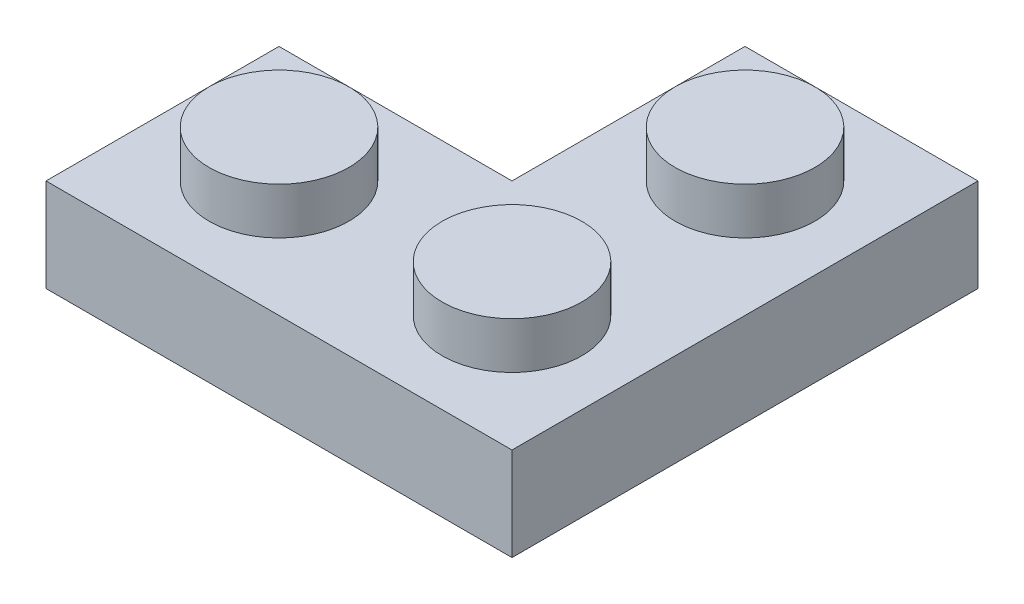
from build123d import *

# Parameters (mm, degrees)
SKETCH1_W           = 16
SKETCH1_H           = 3.2
BOSS_EXTRUDE1_DEPTH = 8
SKETCH2_W           = 8
SKETCH2_H           = 3.2
BOSS_EXTRUDE2_DEPTH = 8
SKETCH3_R           = 2.4
BOSS_EXTRUDE3_DEPTH = 1.6
SHELL1_T            = -1.6
SKETCH4_R           = 1.77
BOSS_EXTRUDE4_DEPTH = 1.6


with BuildPart() as part:
    # Sketch1 → Boss-Extrude1 (new body)
    with BuildSketch(Plane.XY):
        with Locations((8, 1.6)):
            Rectangle(SKETCH1_W, SKETCH1_H)
    extrude(amount=-BOSS_EXTRUDE1_DEPTH)

    # Sketch2 → Boss-Extrude2 (add)
    with BuildSketch(Plane(origin=(16, 0, 0), x_dir=(0, 0, -1), z_dir=(1, 0, 0))):
        with Locations((12, 1.6)):
            Rectangle(SKETCH2_W, SKETCH2_H)
    extrude(amount=-BOSS_EXTRUDE2_DEPTH)

    # Sketch3 → Boss-Extrude3 (add)
    with BuildSketch(Plane(origin=(0, 3.2, 0), x_dir=(1, 0, 0), z_dir=(0, 1, 0))):
        with Locations(Location((12, 12, 0), (0, 0, 180))):
            Circle(SKETCH3_R)
        with Locations(Location((12, 4, 0), (0, 0, 180))):
            Circle(SKETCH3_R)
        with Locations(Location((4, 4, 0), (0, 0, 180))):
            Circle(SKETCH3_R)
    extrude(amount=BOSS_EXTRUDE3_DEPTH)

    # Shell1
    shell1_openings = [part.faces().sort_by_distance(p)[0] for p in [
        (9.333333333, 0, -6.666666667),
    ]]
    offset(amount=SHELL1_T, openings=shell1_openings, kind=Kind.INTERSECTION)

    # Sketch4 → Boss-Extrude4 (add)
    with BuildSketch(Plane.XZ.offset(-1.6)):
        with Locations(Location((8, -4, 0), (0, 0, 180))):
            Circle(SKETCH4_R)
        with Locations(Location((12, -8, 0), (0, 0, 180))):
            Circle(SKETCH4_R)
    extrude(amount=BOSS_EXTRUDE4_DEPTH)


solid = part.part
